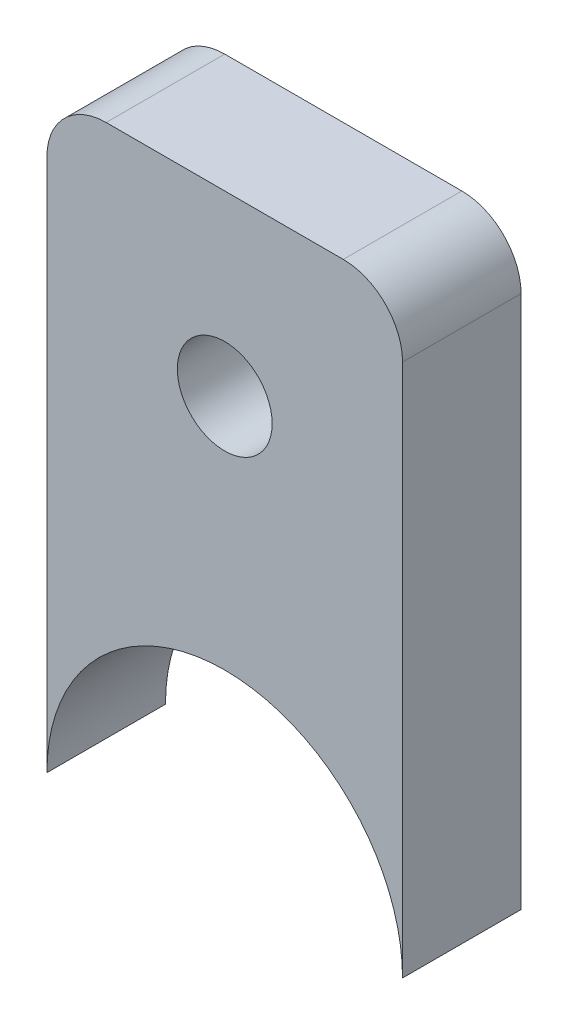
ISO-10303-21;
HEADER;
FILE_DESCRIPTION(('STEP AP214'),'2;1');
FILE_NAME('part.step','',(''),(''),'','','');
FILE_SCHEMA(('AUTOMOTIVE_DESIGN { 1 0 10303 214 1 1 1 1 }'));
ENDSEC;
DATA;
#1=APPLICATION_CONTEXT('core data for automotive mechanical design processes');
#2=APPLICATION_PROTOCOL_DEFINITION('international standard','automotive_design',2000,#1);
#3=PRODUCT_CONTEXT('',#1,'mechanical');
#4=PRODUCT('Part','Part','',(#3));
#5=PRODUCT_RELATED_PRODUCT_CATEGORY('part','',(#4));
#6=PRODUCT_DEFINITION_FORMATION('','',#4);
#7=PRODUCT_DEFINITION_CONTEXT('part definition',#1,'design');
#8=PRODUCT_DEFINITION('design','',#6,#7);
#9=PRODUCT_DEFINITION_SHAPE('','',#8);
#10=(LENGTH_UNIT() NAMED_UNIT(*) SI_UNIT(.MILLI.,.METRE.));
#11=(NAMED_UNIT(*) PLANE_ANGLE_UNIT() SI_UNIT($,.RADIAN.));
#12=(NAMED_UNIT(*) SI_UNIT($,.STERADIAN.) SOLID_ANGLE_UNIT());
#13=UNCERTAINTY_MEASURE_WITH_UNIT(LENGTH_MEASURE(1.E-05),#10,'distance_accuracy_value','');
#14=(GEOMETRIC_REPRESENTATION_CONTEXT(3) GLOBAL_UNCERTAINTY_ASSIGNED_CONTEXT((#13)) GLOBAL_UNIT_ASSIGNED_CONTEXT((#10,
#11,#12)) REPRESENTATION_CONTEXT('',''));
#15=CARTESIAN_POINT('',(0.,0.,0.));
#16=DIRECTION('',(0.,0.,1.));
#17=DIRECTION('',(1.,0.,0.));
#18=AXIS2_PLACEMENT_3D('',#15,#16,#17);
#19=CARTESIAN_POINT('',(15.,0.,-5.));
#20=DIRECTION('',(0.,0.,1.));
#21=DIRECTION('',(1.,0.,0.));
#22=AXIS2_PLACEMENT_3D('',#19,#20,#21);
#23=CYLINDRICAL_SURFACE('',#22,15.);
#24=DIRECTION('',(0.,0.,1.));
#25=VECTOR('',#24,1.);
#26=CARTESIAN_POINT('',(30.,0.,-5.));
#27=LINE('',#26,#25);
#28=CARTESIAN_POINT('',(30.,0.,-5.));
#29=VERTEX_POINT('',#28);
#30=CARTESIAN_POINT('',(30.,0.,5.));
#31=VERTEX_POINT('',#30);
#32=EDGE_CURVE('E88',#29,#31,#27,.T.);
#33=ORIENTED_EDGE('',*,*,#32,.T.);
#34=CARTESIAN_POINT('',(15.,0.,5.));
#35=DIRECTION('',(0.,0.,-1.));
#36=DIRECTION('',(1.,0.,0.));
#37=AXIS2_PLACEMENT_3D('',#34,#35,#36);
#38=CIRCLE('',#37,15.);
#39=CARTESIAN_POINT('',(0.,0.,5.));
#40=VERTEX_POINT('',#39);
#41=EDGE_CURVE('E92',#40,#31,#38,.T.);
#42=ORIENTED_EDGE('',*,*,#41,.F.);
#43=DIRECTION('',(0.,0.,1.));
#44=VECTOR('',#43,1.);
#45=CARTESIAN_POINT('',(0.,0.,-5.));
#46=LINE('',#45,#44);
#47=CARTESIAN_POINT('',(0.,0.,-5.));
#48=VERTEX_POINT('',#47);
#49=EDGE_CURVE('E96',#48,#40,#46,.T.);
#50=ORIENTED_EDGE('',*,*,#49,.F.);
#51=CARTESIAN_POINT('',(15.,0.,-5.));
#52=DIRECTION('',(0.,0.,-1.));
#53=DIRECTION('',(1.,0.,0.));
#54=AXIS2_PLACEMENT_3D('',#51,#52,#53);
#55=CIRCLE('',#54,15.);
#56=EDGE_CURVE('E94',#48,#29,#55,.T.);
#57=ORIENTED_EDGE('',*,*,#56,.T.);
#58=EDGE_LOOP('',(#33,#42,#50,#57));
#59=FACE_BOUND('',#58,.T.);
#60=ADVANCED_FACE('F32',(#59),#23,.F.);
#61=CARTESIAN_POINT('',(0.,0.,-5.));
#62=DIRECTION('',(-1.,0.,0.));
#63=DIRECTION('',(0.,0.,1.));
#64=AXIS2_PLACEMENT_3D('',#61,#62,#63);
#65=PLANE('',#64);
#66=DIRECTION('',(0.,-1.,0.));
#67=VECTOR('',#66,1.);
#68=CARTESIAN_POINT('',(0.,0.,5.));
#69=LINE('',#68,#67);
#70=CARTESIAN_POINT('',(0.,45.,5.));
#71=VERTEX_POINT('',#70);
#72=EDGE_CURVE('E108',#71,#40,#69,.T.);
#73=ORIENTED_EDGE('',*,*,#72,.F.);
#74=DIRECTION('',(0.,0.,1.));
#75=VECTOR('',#74,1.);
#76=CARTESIAN_POINT('',(0.,45.,-5.));
#77=LINE('',#76,#75);
#78=CARTESIAN_POINT('',(0.,45.,-5.));
#79=VERTEX_POINT('',#78);
#80=EDGE_CURVE('E55',#71,#79,#77,.F.);
#81=ORIENTED_EDGE('',*,*,#80,.T.);
#82=DIRECTION('',(0.,-1.,0.));
#83=VECTOR('',#82,1.);
#84=CARTESIAN_POINT('',(0.,0.,-5.));
#85=LINE('',#84,#83);
#86=EDGE_CURVE('E97',#79,#48,#85,.T.);
#87=ORIENTED_EDGE('',*,*,#86,.T.);
#88=ORIENTED_EDGE('',*,*,#49,.T.);
#89=EDGE_LOOP('',(#73,#81,#87,#88));
#90=FACE_BOUND('',#89,.T.);
#91=ADVANCED_FACE('F146',(#90),#65,.T.);
#92=CARTESIAN_POINT('',(0.,50.,-5.));
#93=DIRECTION('',(0.,1.,0.));
#94=DIRECTION('',(0.,0.,1.));
#95=AXIS2_PLACEMENT_3D('',#92,#93,#94);
#96=PLANE('',#95);
#97=DIRECTION('',(-1.,0.,0.));
#98=VECTOR('',#97,1.);
#99=CARTESIAN_POINT('',(0.,50.,-5.));
#100=LINE('',#99,#98);
#101=CARTESIAN_POINT('',(25.,50.,-5.));
#102=VERTEX_POINT('',#101);
#103=CARTESIAN_POINT('',(5.,50.,-5.));
#104=VERTEX_POINT('',#103);
#105=EDGE_CURVE('E122',#102,#104,#100,.T.);
#106=ORIENTED_EDGE('',*,*,#105,.T.);
#107=DIRECTION('',(0.,0.,1.));
#108=VECTOR('',#107,1.);
#109=CARTESIAN_POINT('',(5.,50.,-5.));
#110=LINE('',#109,#108);
#111=CARTESIAN_POINT('',(5.,50.,5.));
#112=VERTEX_POINT('',#111);
#113=EDGE_CURVE('E129',#104,#112,#110,.T.);
#114=ORIENTED_EDGE('',*,*,#113,.T.);
#115=DIRECTION('',(-1.,0.,0.));
#116=VECTOR('',#115,1.);
#117=CARTESIAN_POINT('',(0.,50.,5.));
#118=LINE('',#117,#116);
#119=CARTESIAN_POINT('',(25.,50.,5.));
#120=VERTEX_POINT('',#119);
#121=EDGE_CURVE('E104',#120,#112,#118,.T.);
#122=ORIENTED_EDGE('',*,*,#121,.F.);
#123=DIRECTION('',(0.,0.,1.));
#124=VECTOR('',#123,1.);
#125=CARTESIAN_POINT('',(25.,50.,-5.));
#126=LINE('',#125,#124);
#127=EDGE_CURVE('E126',#120,#102,#126,.F.);
#128=ORIENTED_EDGE('',*,*,#127,.T.);
#129=EDGE_LOOP('',(#106,#114,#122,#128));
#130=FACE_BOUND('',#129,.T.);
#131=ADVANCED_FACE('F142',(#130),#96,.T.);
#132=CARTESIAN_POINT('',(30.,0.,-5.));
#133=DIRECTION('',(1.,0.,0.));
#134=DIRECTION('',(0.,0.,-1.));
#135=AXIS2_PLACEMENT_3D('',#132,#133,#134);
#136=PLANE('',#135);
#137=DIRECTION('',(0.,1.,0.));
#138=VECTOR('',#137,1.);
#139=CARTESIAN_POINT('',(30.,0.,-5.));
#140=LINE('',#139,#138);
#141=CARTESIAN_POINT('',(30.,45.,-5.));
#142=VERTEX_POINT('',#141);
#143=EDGE_CURVE('E120',#29,#142,#140,.T.);
#144=ORIENTED_EDGE('',*,*,#143,.T.);
#145=DIRECTION('',(0.,0.,1.));
#146=VECTOR('',#145,1.);
#147=CARTESIAN_POINT('',(30.,45.,-5.));
#148=LINE('',#147,#146);
#149=CARTESIAN_POINT('',(30.,45.,5.));
#150=VERTEX_POINT('',#149);
#151=EDGE_CURVE('E11',#142,#150,#148,.T.);
#152=ORIENTED_EDGE('',*,*,#151,.T.);
#153=DIRECTION('',(0.,1.,0.));
#154=VECTOR('',#153,1.);
#155=CARTESIAN_POINT('',(30.,0.,5.));
#156=LINE('',#155,#154);
#157=EDGE_CURVE('E100',#31,#150,#156,.T.);
#158=ORIENTED_EDGE('',*,*,#157,.F.);
#159=ORIENTED_EDGE('',*,*,#32,.F.);
#160=EDGE_LOOP('',(#144,#152,#158,#159));
#161=FACE_BOUND('',#160,.T.);
#162=ADVANCED_FACE('F101',(#161),#136,.T.);
#163=CARTESIAN_POINT('',(15.,0.,-5.));
#164=DIRECTION('',(0.,0.,1.));
#165=DIRECTION('',(1.,0.,0.));
#166=AXIS2_PLACEMENT_3D('',#163,#164,#165);
#167=PLANE('',#166);
#168=CARTESIAN_POINT('',(15.,35.,-5.));
#169=DIRECTION('',(0.,0.,1.));
#170=DIRECTION('',(1.,0.,0.));
#171=AXIS2_PLACEMENT_3D('',#168,#169,#170);
#172=CIRCLE('',#171,4.);
#173=CARTESIAN_POINT('',(19.,35.,-5.));
#174=VERTEX_POINT('',#173);
#175=EDGE_CURVE('E110',#174,#174,#172,.T.);
#176=ORIENTED_EDGE('',*,*,#175,.T.);
#177=EDGE_LOOP('',(#176));
#178=FACE_BOUND('',#177,.T.);
#179=ORIENTED_EDGE('',*,*,#86,.F.);
#180=CARTESIAN_POINT('',(5.,45.,-5.));
#181=DIRECTION('',(0.,0.,1.));
#182=DIRECTION('',(1.,0.,0.));
#183=AXIS2_PLACEMENT_3D('',#180,#181,#182);
#184=CIRCLE('',#183,5.);
#185=EDGE_CURVE('E40',#79,#104,#184,.F.);
#186=ORIENTED_EDGE('',*,*,#185,.T.);
#187=ORIENTED_EDGE('',*,*,#105,.F.);
#188=CARTESIAN_POINT('',(25.,45.,-5.));
#189=DIRECTION('',(0.,0.,1.));
#190=DIRECTION('',(1.,0.,0.));
#191=AXIS2_PLACEMENT_3D('',#188,#189,#190);
#192=CIRCLE('',#191,5.);
#193=EDGE_CURVE('E47',#102,#142,#192,.F.);
#194=ORIENTED_EDGE('',*,*,#193,.T.);
#195=ORIENTED_EDGE('',*,*,#143,.F.);
#196=ORIENTED_EDGE('',*,*,#56,.F.);
#197=EDGE_LOOP('',(#179,#186,#187,#194,#195,#196));
#198=FACE_BOUND('',#197,.T.);
#199=ADVANCED_FACE('F138',(#178,#198),#167,.F.);
#200=CARTESIAN_POINT('',(15.,0.,5.));
#201=DIRECTION('',(0.,0.,1.));
#202=DIRECTION('',(1.,0.,0.));
#203=AXIS2_PLACEMENT_3D('',#200,#201,#202);
#204=PLANE('',#203);
#205=CARTESIAN_POINT('',(15.,35.,5.));
#206=DIRECTION('',(0.,0.,1.));
#207=DIRECTION('',(1.,0.,0.));
#208=AXIS2_PLACEMENT_3D('',#205,#206,#207);
#209=CIRCLE('',#208,4.);
#210=CARTESIAN_POINT('',(19.,35.,5.));
#211=VERTEX_POINT('',#210);
#212=EDGE_CURVE('E113',#211,#211,#209,.T.);
#213=ORIENTED_EDGE('',*,*,#212,.F.);
#214=EDGE_LOOP('',(#213));
#215=FACE_BOUND('',#214,.T.);
#216=ORIENTED_EDGE('',*,*,#121,.T.);
#217=CARTESIAN_POINT('',(5.,45.,5.));
#218=DIRECTION('',(0.,0.,1.));
#219=DIRECTION('',(1.,0.,0.));
#220=AXIS2_PLACEMENT_3D('',#217,#218,#219);
#221=CIRCLE('',#220,5.);
#222=EDGE_CURVE('E134',#112,#71,#221,.T.);
#223=ORIENTED_EDGE('',*,*,#222,.T.);
#224=ORIENTED_EDGE('',*,*,#72,.T.);
#225=ORIENTED_EDGE('',*,*,#41,.T.);
#226=ORIENTED_EDGE('',*,*,#157,.T.);
#227=CARTESIAN_POINT('',(25.,45.,5.));
#228=DIRECTION('',(0.,0.,1.));
#229=DIRECTION('',(1.,0.,0.));
#230=AXIS2_PLACEMENT_3D('',#227,#228,#229);
#231=CIRCLE('',#230,5.);
#232=EDGE_CURVE('E132',#150,#120,#231,.T.);
#233=ORIENTED_EDGE('',*,*,#232,.T.);
#234=EDGE_LOOP('',(#216,#223,#224,#225,#226,#233));
#235=FACE_BOUND('',#234,.T.);
#236=ADVANCED_FACE('F107',(#215,#235),#204,.T.);
#237=CARTESIAN_POINT('',(5.,45.,-5.));
#238=DIRECTION('',(0.,0.,1.));
#239=DIRECTION('',(1.,0.,0.));
#240=AXIS2_PLACEMENT_3D('',#237,#238,#239);
#241=CYLINDRICAL_SURFACE('',#240,5.);
#242=ORIENTED_EDGE('',*,*,#185,.F.);
#243=ORIENTED_EDGE('',*,*,#80,.F.);
#244=ORIENTED_EDGE('',*,*,#222,.F.);
#245=ORIENTED_EDGE('',*,*,#113,.F.);
#246=EDGE_LOOP('',(#242,#243,#244,#245));
#247=FACE_BOUND('',#246,.T.);
#248=ADVANCED_FACE('F145',(#247),#241,.T.);
#249=CARTESIAN_POINT('',(25.,45.,-5.));
#250=DIRECTION('',(0.,0.,1.));
#251=DIRECTION('',(1.,0.,0.));
#252=AXIS2_PLACEMENT_3D('',#249,#250,#251);
#253=CYLINDRICAL_SURFACE('',#252,5.);
#254=ORIENTED_EDGE('',*,*,#193,.F.);
#255=ORIENTED_EDGE('',*,*,#127,.F.);
#256=ORIENTED_EDGE('',*,*,#232,.F.);
#257=ORIENTED_EDGE('',*,*,#151,.F.);
#258=EDGE_LOOP('',(#254,#255,#256,#257));
#259=FACE_BOUND('',#258,.T.);
#260=ADVANCED_FACE('F34',(#259),#253,.T.);
#261=CARTESIAN_POINT('',(15.,35.,-5.));
#262=DIRECTION('',(0.,0.,1.));
#263=DIRECTION('',(1.,0.,0.));
#264=AXIS2_PLACEMENT_3D('',#261,#262,#263);
#265=CYLINDRICAL_SURFACE('',#264,4.);
#266=ORIENTED_EDGE('',*,*,#175,.F.);
#267=EDGE_LOOP('',(#266));
#268=FACE_BOUND('',#267,.T.);
#269=ORIENTED_EDGE('',*,*,#212,.T.);
#270=EDGE_LOOP('',(#269));
#271=FACE_BOUND('',#270,.T.);
#272=ADVANCED_FACE('F149',(#268,#271),#265,.F.);
#273=CLOSED_SHELL('',(#60,#91,#131,#162,#199,#236,#248,#260,#272));
#274=MANIFOLD_SOLID_BREP('B2',#273);
#275=ADVANCED_BREP_SHAPE_REPRESENTATION('',(#18,#274),#14);
#276=SHAPE_DEFINITION_REPRESENTATION(#9,#275);
ENDSEC;
END-ISO-10303-21;
